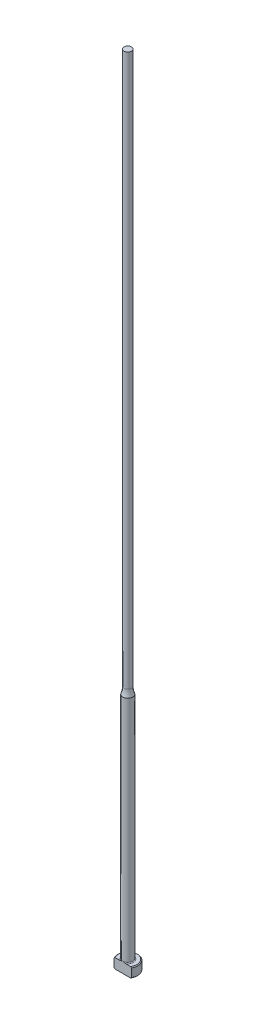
from build123d import *

# Parameters (mm, degrees)
CHAMFER1_SIZE      = 0.254
FILLET1_R          = 0.254
CUT_EXTRUDE1_DEPTH = 255.0396844


with BuildPart() as part:
    # Sketch1 → Revolve1 (revolve)
    with BuildSketch(Plane.XY, mode=Mode.PRIVATE) as revolve1_sk:
        with BuildLine():
            Line((0, 0), (-3.175, 0))
            Line((-3.175, 0), (-3.175, 3.175))
            Line((-3.175, 3.175), (-1.5875, 3.175))
            Line((-1.5875, 3.175), (-1.5875, 76.2))
            ThreePointArc((-1.5875, 76.2), (-1.290157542, 77.287986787), (-1.18999, 78.411416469))
            Line((-1.18999, 78.411416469), (-1.18999, 254))
            Line((-1.18999, 254), (0, 254))
            Line((0, 254), (0, 0))
        make_face()
    revolve(revolve1_sk.sketch.rotate(Axis((0, 259.958771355, 0), (0, -1, 0)), 270), axis=Axis((0, 259.958771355, 0), (0, -1, 0)))

    # Chamfer1
    chamfer1_edges = [part.edges().sort_by_distance(p)[0] for p in [
        (0, 0, -3.175),
        (0, 3.175, -3.175),
    ]]
    chamfer(chamfer1_edges, length=CHAMFER1_SIZE)

    # Fillet1
    fillet1_edges = [part.edges().sort_by_distance(p)[0] for p in [
        (0, 3.175, -1.5875),
    ]]
    fillet(fillet1_edges, radius=FILLET1_R)

    # Sketch2 → Cut-Extrude1 (cut, through all)
    with BuildSketch(Plane.XZ):
        with BuildLine():
            Line((-2.749630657, 1.5875), (2.749630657, 1.5875))
            ThreePointArc((2.749630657, 1.5875), (0, 3.175), (-2.749630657, 1.5875))
        make_face()
    extrude(amount=-CUT_EXTRUDE1_DEPTH, mode=Mode.SUBTRACT)


solid = part.part
